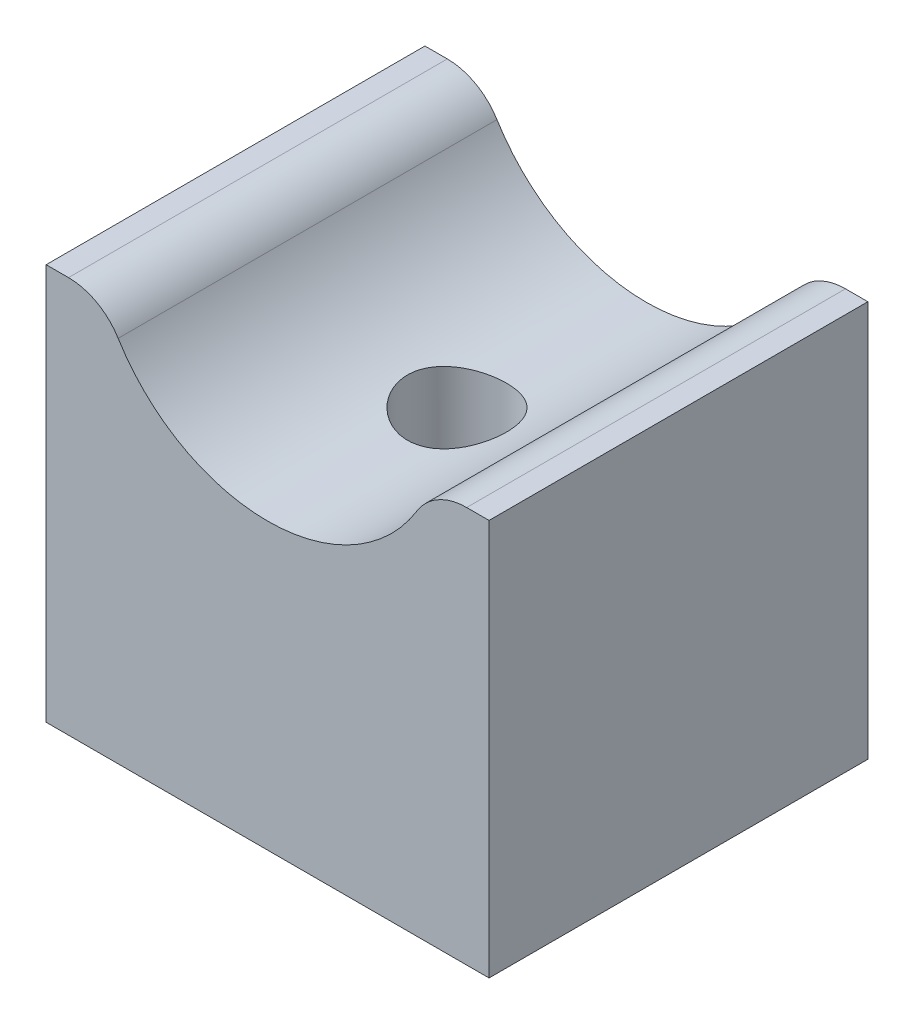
ISO-10303-21;
HEADER;
FILE_DESCRIPTION(('STEP AP214'),'2;1');
FILE_NAME('part.step','',(''),(''),'','','');
FILE_SCHEMA(('AUTOMOTIVE_DESIGN { 1 0 10303 214 1 1 1 1 }'));
ENDSEC;
DATA;
#1=APPLICATION_CONTEXT('core data for automotive mechanical design processes');
#2=APPLICATION_PROTOCOL_DEFINITION('international standard','automotive_design',2000,#1);
#3=PRODUCT_CONTEXT('',#1,'mechanical');
#4=PRODUCT('Part','Part','',(#3));
#5=PRODUCT_RELATED_PRODUCT_CATEGORY('part','',(#4));
#6=PRODUCT_DEFINITION_FORMATION('','',#4);
#7=PRODUCT_DEFINITION_CONTEXT('part definition',#1,'design');
#8=PRODUCT_DEFINITION('design','',#6,#7);
#9=PRODUCT_DEFINITION_SHAPE('','',#8);
#10=(LENGTH_UNIT() NAMED_UNIT(*) SI_UNIT(.MILLI.,.METRE.));
#11=(NAMED_UNIT(*) PLANE_ANGLE_UNIT() SI_UNIT($,.RADIAN.));
#12=(NAMED_UNIT(*) SI_UNIT($,.STERADIAN.) SOLID_ANGLE_UNIT());
#13=UNCERTAINTY_MEASURE_WITH_UNIT(LENGTH_MEASURE(1.E-05),#10,'distance_accuracy_value','');
#14=(GEOMETRIC_REPRESENTATION_CONTEXT(3) GLOBAL_UNCERTAINTY_ASSIGNED_CONTEXT((#13)) GLOBAL_UNIT_ASSIGNED_CONTEXT((#10,
#11,#12)) REPRESENTATION_CONTEXT('',''));
#15=CARTESIAN_POINT('',(0.,0.,0.));
#16=DIRECTION('',(0.,0.,1.));
#17=DIRECTION('',(1.,0.,0.));
#18=AXIS2_PLACEMENT_3D('',#15,#16,#17);
#19=CARTESIAN_POINT('',(-19.,17.,32.5));
#20=DIRECTION('',(0.,-1.,0.));
#21=DIRECTION('',(0.,0.,-1.));
#22=AXIS2_PLACEMENT_3D('',#19,#20,#21);
#23=PLANE('',#22);
#24=DIRECTION('',(-1.,0.,0.));
#25=VECTOR('',#24,1.);
#26=CARTESIAN_POINT('',(-19.,17.,32.5));
#27=LINE('',#26,#25);
#28=CARTESIAN_POINT('',(-17.0807640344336,17.,32.5));
#29=VERTEX_POINT('',#28);
#30=CARTESIAN_POINT('',(-19.,17.,32.5));
#31=VERTEX_POINT('',#30);
#32=EDGE_CURVE('E112',#29,#31,#27,.T.);
#33=ORIENTED_EDGE('',*,*,#32,.F.);
#34=DIRECTION('',(0.,0.,1.));
#35=VECTOR('',#34,1.);
#36=CARTESIAN_POINT('',(-17.0807640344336,17.,0.));
#37=LINE('',#36,#35);
#38=CARTESIAN_POINT('',(-17.0807640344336,17.,0.));
#39=VERTEX_POINT('',#38);
#40=EDGE_CURVE('E12',#29,#39,#37,.F.);
#41=ORIENTED_EDGE('',*,*,#40,.T.);
#42=DIRECTION('',(-1.,0.,0.));
#43=VECTOR('',#42,1.);
#44=CARTESIAN_POINT('',(-19.,17.,0.));
#45=LINE('',#44,#43);
#46=CARTESIAN_POINT('',(-19.,17.,0.));
#47=VERTEX_POINT('',#46);
#48=EDGE_CURVE('E185',#39,#47,#45,.T.);
#49=ORIENTED_EDGE('',*,*,#48,.T.);
#50=DIRECTION('',(0.,0.,-1.));
#51=VECTOR('',#50,1.);
#52=CARTESIAN_POINT('',(-19.,17.,32.5));
#53=LINE('',#52,#51);
#54=EDGE_CURVE('E131',#31,#47,#53,.T.);
#55=ORIENTED_EDGE('',*,*,#54,.F.);
#56=EDGE_LOOP('',(#33,#41,#49,#55));
#57=FACE_BOUND('',#56,.T.);
#58=ADVANCED_FACE('F39',(#57),#23,.F.);
#59=CARTESIAN_POINT('',(19.,17.,0.));
#60=VERTEX_POINT('',#59);
#61=CARTESIAN_POINT('',(17.0807640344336,17.,0.));
#62=VERTEX_POINT('',#61);
#63=EDGE_CURVE('E181',#60,#62,#45,.T.);
#64=ORIENTED_EDGE('',*,*,#63,.T.);
#65=DIRECTION('',(0.,0.,1.));
#66=VECTOR('',#65,1.);
#67=CARTESIAN_POINT('',(17.0807640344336,17.,32.5));
#68=LINE('',#67,#66);
#69=CARTESIAN_POINT('',(17.0807640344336,17.,32.5));
#70=VERTEX_POINT('',#69);
#71=EDGE_CURVE('E63',#62,#70,#68,.T.);
#72=ORIENTED_EDGE('',*,*,#71,.T.);
#73=CARTESIAN_POINT('',(19.,17.,32.5));
#74=VERTEX_POINT('',#73);
#75=EDGE_CURVE('E103',#74,#70,#27,.T.);
#76=ORIENTED_EDGE('',*,*,#75,.F.);
#77=DIRECTION('',(0.,0.,-1.));
#78=VECTOR('',#77,1.);
#79=CARTESIAN_POINT('',(19.,17.,32.5));
#80=LINE('',#79,#78);
#81=EDGE_CURVE('E107',#74,#60,#80,.T.);
#82=ORIENTED_EDGE('',*,*,#81,.T.);
#83=EDGE_LOOP('',(#64,#72,#76,#82));
#84=FACE_BOUND('',#83,.T.);
#85=ADVANCED_FACE('F105',(#84),#23,.F.);
#86=CARTESIAN_POINT('',(19.,17.,32.5));
#87=DIRECTION('',(-1.,0.,0.));
#88=DIRECTION('',(0.,-1.,0.));
#89=AXIS2_PLACEMENT_3D('',#86,#87,#88);
#90=PLANE('',#89);
#91=DIRECTION('',(0.,1.,0.));
#92=VECTOR('',#91,1.);
#93=CARTESIAN_POINT('',(19.,17.,0.));
#94=LINE('',#93,#92);
#95=CARTESIAN_POINT('',(19.,-17.,0.));
#96=VERTEX_POINT('',#95);
#97=EDGE_CURVE('E128',#96,#60,#94,.T.);
#98=ORIENTED_EDGE('',*,*,#97,.T.);
#99=ORIENTED_EDGE('',*,*,#81,.F.);
#100=DIRECTION('',(0.,1.,0.));
#101=VECTOR('',#100,1.);
#102=CARTESIAN_POINT('',(19.,17.,32.5));
#103=LINE('',#102,#101);
#104=CARTESIAN_POINT('',(19.,-17.,32.5));
#105=VERTEX_POINT('',#104);
#106=EDGE_CURVE('E115',#105,#74,#103,.T.);
#107=ORIENTED_EDGE('',*,*,#106,.F.);
#108=DIRECTION('',(0.,0.,-1.));
#109=VECTOR('',#108,1.);
#110=CARTESIAN_POINT('',(19.,-17.,32.5));
#111=LINE('',#110,#109);
#112=EDGE_CURVE('E164',#105,#96,#111,.T.);
#113=ORIENTED_EDGE('',*,*,#112,.T.);
#114=EDGE_LOOP('',(#98,#99,#107,#113));
#115=FACE_BOUND('',#114,.T.);
#116=ADVANCED_FACE('F126',(#115),#90,.F.);
#117=CARTESIAN_POINT('',(-19.,17.,32.5));
#118=DIRECTION('',(1.,0.,0.));
#119=DIRECTION('',(0.,1.,0.));
#120=AXIS2_PLACEMENT_3D('',#117,#118,#119);
#121=PLANE('',#120);
#122=DIRECTION('',(0.,-1.,0.));
#123=VECTOR('',#122,1.);
#124=CARTESIAN_POINT('',(-19.,17.,0.));
#125=LINE('',#124,#123);
#126=CARTESIAN_POINT('',(-19.,-17.,0.));
#127=VERTEX_POINT('',#126);
#128=EDGE_CURVE('E171',#47,#127,#125,.T.);
#129=ORIENTED_EDGE('',*,*,#128,.T.);
#130=DIRECTION('',(0.,0.,-1.));
#131=VECTOR('',#130,1.);
#132=CARTESIAN_POINT('',(-19.,-17.,32.5));
#133=LINE('',#132,#131);
#134=CARTESIAN_POINT('',(-19.,-17.,32.5));
#135=VERTEX_POINT('',#134);
#136=EDGE_CURVE('E140',#135,#127,#133,.T.);
#137=ORIENTED_EDGE('',*,*,#136,.F.);
#138=DIRECTION('',(0.,-1.,0.));
#139=VECTOR('',#138,1.);
#140=CARTESIAN_POINT('',(-19.,17.,32.5));
#141=LINE('',#140,#139);
#142=EDGE_CURVE('E111',#31,#135,#141,.T.);
#143=ORIENTED_EDGE('',*,*,#142,.F.);
#144=ORIENTED_EDGE('',*,*,#54,.T.);
#145=EDGE_LOOP('',(#129,#137,#143,#144));
#146=FACE_BOUND('',#145,.T.);
#147=ADVANCED_FACE('F296',(#146),#121,.F.);
#148=CARTESIAN_POINT('',(-19.,-17.,32.5));
#149=DIRECTION('',(0.,1.,0.));
#150=DIRECTION('',(0.,0.,1.));
#151=AXIS2_PLACEMENT_3D('',#148,#149,#150);
#152=PLANE('',#151);
#153=CARTESIAN_POINT('',(0.,-17.,16.25));
#154=DIRECTION('',(0.,-1.,0.));
#155=DIRECTION('',(0.,0.,-1.));
#156=AXIS2_PLACEMENT_3D('',#153,#154,#155);
#157=CIRCLE('',#156,7.5065);
#158=CARTESIAN_POINT('',(0.,-17.,8.7435));
#159=VERTEX_POINT('',#158);
#160=EDGE_CURVE('E251',#159,#159,#157,.T.);
#161=ORIENTED_EDGE('',*,*,#160,.F.);
#162=EDGE_LOOP('',(#161));
#163=FACE_BOUND('',#162,.T.);
#164=DIRECTION('',(1.,0.,0.));
#165=VECTOR('',#164,1.);
#166=CARTESIAN_POINT('',(-19.,-17.,0.));
#167=LINE('',#166,#165);
#168=EDGE_CURVE('E124',#127,#96,#167,.T.);
#169=ORIENTED_EDGE('',*,*,#168,.T.);
#170=ORIENTED_EDGE('',*,*,#112,.F.);
#171=DIRECTION('',(1.,0.,0.));
#172=VECTOR('',#171,1.);
#173=CARTESIAN_POINT('',(-19.,-17.,32.5));
#174=LINE('',#173,#172);
#175=EDGE_CURVE('E119',#135,#105,#174,.T.);
#176=ORIENTED_EDGE('',*,*,#175,.F.);
#177=ORIENTED_EDGE('',*,*,#136,.T.);
#178=EDGE_LOOP('',(#169,#170,#176,#177));
#179=FACE_BOUND('',#178,.T.);
#180=ADVANCED_FACE('F292',(#163,#179),#152,.F.);
#181=CARTESIAN_POINT('',(0.,0.,32.5));
#182=DIRECTION('',(0.,0.,1.));
#183=DIRECTION('',(1.,0.,0.));
#184=AXIS2_PLACEMENT_3D('',#181,#182,#183);
#185=PLANE('',#184);
#186=ORIENTED_EDGE('',*,*,#75,.T.);
#187=CARTESIAN_POINT('',(17.0807640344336,12.,32.5));
#188=DIRECTION('',(0.,0.,1.));
#189=DIRECTION('',(1.,0.,0.));
#190=AXIS2_PLACEMENT_3D('',#187,#188,#189);
#191=CIRCLE('',#190,5.);
#192=CARTESIAN_POINT('',(12.8212218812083,14.6184538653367,32.5));
#193=VERTEX_POINT('',#192);
#194=EDGE_CURVE('E48',#70,#193,#191,.T.);
#195=ORIENTED_EDGE('',*,*,#194,.T.);
#196=CARTESIAN_POINT('',(0.,22.5,32.5));
#197=DIRECTION('',(0.,0.,1.));
#198=DIRECTION('',(1.,0.,0.));
#199=AXIS2_PLACEMENT_3D('',#196,#197,#198);
#200=CIRCLE('',#199,15.05);
#201=CARTESIAN_POINT('',(-12.8212218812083,14.6184538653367,32.5));
#202=VERTEX_POINT('',#201);
#203=EDGE_CURVE('E190',#202,#193,#200,.T.);
#204=ORIENTED_EDGE('',*,*,#203,.F.);
#205=CARTESIAN_POINT('',(-17.0807640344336,12.,32.5));
#206=DIRECTION('',(0.,0.,1.));
#207=DIRECTION('',(1.,0.,0.));
#208=AXIS2_PLACEMENT_3D('',#205,#206,#207);
#209=CIRCLE('',#208,5.);
#210=EDGE_CURVE('E55',#202,#29,#209,.T.);
#211=ORIENTED_EDGE('',*,*,#210,.T.);
#212=ORIENTED_EDGE('',*,*,#32,.T.);
#213=ORIENTED_EDGE('',*,*,#142,.T.);
#214=ORIENTED_EDGE('',*,*,#175,.T.);
#215=ORIENTED_EDGE('',*,*,#106,.T.);
#216=EDGE_LOOP('',(#186,#195,#204,#211,#212,#213,#214,#215));
#217=FACE_BOUND('',#216,.T.);
#218=ADVANCED_FACE('F117',(#217),#185,.T.);
#219=CARTESIAN_POINT('',(0.,0.,0.));
#220=DIRECTION('',(0.,0.,1.));
#221=DIRECTION('',(1.,0.,0.));
#222=AXIS2_PLACEMENT_3D('',#219,#220,#221);
#223=PLANE('',#222);
#224=CARTESIAN_POINT('',(0.,22.5,0.));
#225=DIRECTION('',(0.,0.,1.));
#226=DIRECTION('',(1.,0.,0.));
#227=AXIS2_PLACEMENT_3D('',#224,#225,#226);
#228=CIRCLE('',#227,15.05);
#229=CARTESIAN_POINT('',(-12.8212218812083,14.6184538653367,0.));
#230=VERTEX_POINT('',#229);
#231=CARTESIAN_POINT('',(12.8212218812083,14.6184538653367,0.));
#232=VERTEX_POINT('',#231);
#233=EDGE_CURVE('E202',#230,#232,#228,.T.);
#234=ORIENTED_EDGE('',*,*,#233,.T.);
#235=CARTESIAN_POINT('',(17.0807640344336,12.,0.));
#236=DIRECTION('',(0.,0.,1.));
#237=DIRECTION('',(1.,0.,0.));
#238=AXIS2_PLACEMENT_3D('',#235,#236,#237);
#239=CIRCLE('',#238,5.);
#240=EDGE_CURVE('E258',#232,#62,#239,.F.);
#241=ORIENTED_EDGE('',*,*,#240,.T.);
#242=ORIENTED_EDGE('',*,*,#63,.F.);
#243=ORIENTED_EDGE('',*,*,#97,.F.);
#244=ORIENTED_EDGE('',*,*,#168,.F.);
#245=ORIENTED_EDGE('',*,*,#128,.F.);
#246=ORIENTED_EDGE('',*,*,#48,.F.);
#247=CARTESIAN_POINT('',(-17.0807640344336,12.,0.));
#248=DIRECTION('',(0.,0.,1.));
#249=DIRECTION('',(1.,0.,0.));
#250=AXIS2_PLACEMENT_3D('',#247,#248,#249);
#251=CIRCLE('',#250,5.);
#252=EDGE_CURVE('E262',#39,#230,#251,.F.);
#253=ORIENTED_EDGE('',*,*,#252,.T.);
#254=EDGE_LOOP('',(#234,#241,#242,#243,#244,#245,#246,#253));
#255=FACE_BOUND('',#254,.T.);
#256=ADVANCED_FACE('F350',(#255),#223,.F.);
#257=CARTESIAN_POINT('',(0.,22.5,32.5));
#258=DIRECTION('',(0.,0.,-1.));
#259=DIRECTION('',(-1.,0.,0.));
#260=AXIS2_PLACEMENT_3D('',#257,#258,#259);
#261=CYLINDRICAL_SURFACE('',#260,15.05);
#262=CARTESIAN_POINT('',(0.,7.45,12.));
#263=CARTESIAN_POINT('',(-0.233768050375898,7.45000293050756,12.0000043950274));
#264=CARTESIAN_POINT('',(-0.467581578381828,7.45549950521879,12.0193517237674));
#265=CARTESIAN_POINT('',(-0.92843924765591,7.47689124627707,12.0960716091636));
#266=CARTESIAN_POINT('',(-1.15548066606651,7.49279053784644,12.1534592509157));
#267=CARTESIAN_POINT('',(-1.5960777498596,7.53323864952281,12.3042197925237));
#268=CARTESIAN_POINT('',(-1.80965149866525,7.55777556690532,12.3975431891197));
#269=CARTESIAN_POINT('',(-2.21811836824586,7.6129255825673,12.6173335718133));
#270=CARTESIAN_POINT('',(-2.41300965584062,7.64353927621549,12.7438038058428));
#271=CARTESIAN_POINT('',(-2.78359546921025,7.70843691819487,13.029731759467));
#272=CARTESIAN_POINT('',(-2.95874083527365,7.74278945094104,13.1898856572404));
#273=CARTESIAN_POINT('',(-3.28007855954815,7.81086726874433,13.5371486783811));
#274=CARTESIAN_POINT('',(-3.42626669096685,7.84459246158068,13.724261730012));
#275=CARTESIAN_POINT('',(-3.6883141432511,7.90830941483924,14.1246351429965));
#276=CARTESIAN_POINT('',(-3.80352412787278,7.93821522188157,14.3383354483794));
#277=CARTESIAN_POINT('',(-3.9961556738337,7.98989121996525,14.783056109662));
#278=CARTESIAN_POINT('',(-4.07358515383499,8.01166311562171,15.0140728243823));
#279=CARTESIAN_POINT('',(-4.18651698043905,8.04389504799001,15.4807463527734));
#280=CARTESIAN_POINT('',(-4.22302286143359,8.05462528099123,15.7161411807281));
#281=CARTESIAN_POINT('',(-4.25620235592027,8.0643647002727,16.1899398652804));
#282=CARTESIAN_POINT('',(-4.25288440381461,8.06337636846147,16.42834307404));
#283=CARTESIAN_POINT('',(-4.20730321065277,8.0500310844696,16.8934112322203));
#284=CARTESIAN_POINT('',(-4.16627351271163,8.03803423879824,17.1202090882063));
#285=CARTESIAN_POINT('',(-4.04841711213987,8.00460300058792,17.5635624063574));
#286=CARTESIAN_POINT('',(-3.9715872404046,7.98316777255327,17.7801169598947));
#287=CARTESIAN_POINT('',(-3.78335110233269,7.9329719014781,18.1999605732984));
#288=CARTESIAN_POINT('',(-3.67152735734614,7.90412360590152,18.4030515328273));
#289=CARTESIAN_POINT('',(-3.41676840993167,7.84239688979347,18.7880105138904));
#290=CARTESIAN_POINT('',(-3.27382642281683,7.8095175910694,18.9698738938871));
#291=CARTESIAN_POINT('',(-2.95466408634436,7.74195211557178,19.3142402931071));
#292=CARTESIAN_POINT('',(-2.7774132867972,7.70724395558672,19.4757854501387));
#293=CARTESIAN_POINT('',(-2.39790736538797,7.64100978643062,19.7670667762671));
#294=CARTESIAN_POINT('',(-2.19565100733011,7.60948393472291,19.8968013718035));
#295=CARTESIAN_POINT('',(-1.77027446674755,7.55293178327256,20.1212726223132));
#296=CARTESIAN_POINT('',(-1.54704832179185,7.52794120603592,20.2158180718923));
#297=CARTESIAN_POINT('',(-1.08699889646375,7.48753286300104,20.365753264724));
#298=CARTESIAN_POINT('',(-0.850178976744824,7.47211274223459,20.421152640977));
#299=CARTESIAN_POINT('',(-0.377824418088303,7.4529464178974,20.4896777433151));
#300=CARTESIAN_POINT('',(-0.142492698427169,7.44884125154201,20.5041038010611));
#301=CARTESIAN_POINT('',(0.327234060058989,7.45172568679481,20.4938883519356));
#302=CARTESIAN_POINT('',(0.56162920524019,7.45871399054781,20.4692514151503));
#303=CARTESIAN_POINT('',(1.01806587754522,7.48276672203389,20.3826695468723));
#304=CARTESIAN_POINT('',(1.24025952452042,7.499630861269,20.3214657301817));
#305=CARTESIAN_POINT('',(1.6711922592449,7.54150653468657,20.1643622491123));
#306=CARTESIAN_POINT('',(1.87992980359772,7.56651900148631,20.0684586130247));
#307=CARTESIAN_POINT('',(2.28295543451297,7.62273785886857,19.8423720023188));
#308=CARTESIAN_POINT('',(2.47684118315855,7.65406480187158,19.7115025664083));
#309=CARTESIAN_POINT('',(2.84035063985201,7.71930070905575,19.420048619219));
#310=CARTESIAN_POINT('',(3.00996894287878,7.75321024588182,19.2594575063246));
#311=CARTESIAN_POINT('',(3.3257237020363,7.8211372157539,18.907027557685));
#312=CARTESIAN_POINT('',(3.47093857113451,7.85512358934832,18.7143553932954));
#313=CARTESIAN_POINT('',(3.72701552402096,7.91818558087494,18.3066463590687));
#314=CARTESIAN_POINT('',(3.83787885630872,7.94726137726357,18.0916103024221));
#315=CARTESIAN_POINT('',(4.02128979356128,7.99687057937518,17.6462084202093));
#316=CARTESIAN_POINT('',(4.09404479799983,8.01745009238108,17.4159334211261));
#317=CARTESIAN_POINT('',(4.19958075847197,8.04769592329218,16.9457258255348));
#318=CARTESIAN_POINT('',(4.23237347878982,8.05736545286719,16.7057960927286));
#319=CARTESIAN_POINT('',(4.25631892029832,8.06440567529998,16.2325864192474));
#320=CARTESIAN_POINT('',(4.24896206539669,8.06221660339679,15.9993873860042));
#321=CARTESIAN_POINT('',(4.19632050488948,8.04682975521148,15.5376991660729));
#322=CARTESIAN_POINT('',(4.15103701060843,8.03363233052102,15.3092098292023));
#323=CARTESIAN_POINT('',(4.02473839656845,7.99799357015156,14.8655587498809));
#324=CARTESIAN_POINT('',(3.94407520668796,7.97564342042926,14.650288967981));
#325=CARTESIAN_POINT('',(3.74957907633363,7.92422455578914,14.2361693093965));
#326=CARTESIAN_POINT('',(3.63574037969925,7.89515467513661,14.0373222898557));
#327=CARTESIAN_POINT('',(3.37376036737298,7.83238531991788,13.6546682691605));
#328=CARTESIAN_POINT('',(3.22461946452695,7.79856558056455,13.4715653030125));
#329=CARTESIAN_POINT('',(2.89812276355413,7.73073664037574,13.1325015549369));
#330=CARTESIAN_POINT('',(2.72075991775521,7.69672739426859,12.9765475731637));
#331=CARTESIAN_POINT('',(2.33753514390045,7.63133853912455,12.692370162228));
#332=CARTESIAN_POINT('',(2.13107414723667,7.60004536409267,12.5649328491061));
#333=CARTESIAN_POINT('',(1.69877528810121,7.54459911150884,12.3467700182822));
#334=CARTESIAN_POINT('',(1.47294843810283,7.52044201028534,12.2560238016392));
#335=CARTESIAN_POINT('',(1.0403760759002,7.48465499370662,12.1239822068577));
#336=CARTESIAN_POINT('',(0.835273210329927,7.47175974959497,12.0776048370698));
#337=CARTESIAN_POINT('',(0.420125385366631,7.45443147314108,12.0156137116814));
#338=CARTESIAN_POINT('',(0.210081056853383,7.4499973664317,11.9999960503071));
#339=CARTESIAN_POINT('',(0.,7.45,12.));
#340=B_SPLINE_CURVE_WITH_KNOTS('',3,(#262,#263,#264,#265,#266,#267,#268,#269,#270,#271,#272,
#273,#274,#275,#276,#277,#278,#279,#280,#281,#282,#283,#284,#285,#286,#287,#288,#289,#290,#291,
#292,#293,#294,#295,#296,#297,#298,#299,#300,#301,#302,#303,#304,#305,#306,#307,#308,#309,#310,
#311,#312,#313,#314,#315,#316,#317,#318,#319,#320,#321,#322,#323,#324,#325,#326,#327,#328,#329,
#330,#331,#332,#333,#334,#335,#336,#337,#338,#339),.UNSPECIFIED.,.T.,.F.,(4,2,2,2,2,2,2,2,2,2,2,
2,2,2,2,2,2,2,2,2,2,2,2,2,2,2,2,2,2,2,2,2,2,2,2,2,2,2,4),(0.,0.700533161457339,1.40134428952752,
2.10119344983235,2.80111121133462,3.51723970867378,4.23347266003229,4.96371858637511,
5.6938113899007,6.40557992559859,7.11719771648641,7.80633640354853,8.49553610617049,
9.19329337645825,9.89120293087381,10.6147766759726,11.3383862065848,12.0658720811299,
12.7931788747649,13.4971310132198,14.2010008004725,14.8910671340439,15.5812124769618,
16.2860538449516,16.9910519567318,17.7185376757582,18.445996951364,19.1694548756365,
19.8926997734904,20.589283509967,21.2858449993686,21.9756294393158,22.6655336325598,
23.3779878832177,24.0906203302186,24.8209758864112,25.5509188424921,26.180549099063,
26.8100994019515),.UNSPECIFIED.);
#341=CARTESIAN_POINT('',(0.,7.45,12.));
#342=VERTEX_POINT('',#341);
#343=EDGE_CURVE('E146',#342,#342,#340,.T.);
#344=ORIENTED_EDGE('',*,*,#343,.F.);
#345=EDGE_LOOP('',(#344));
#346=FACE_BOUND('',#345,.T.);
#347=ORIENTED_EDGE('',*,*,#203,.T.);
#348=DIRECTION('',(0.,0.,-1.));
#349=VECTOR('',#348,1.);
#350=CARTESIAN_POINT('',(12.8212218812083,14.6184538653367,32.5));
#351=LINE('',#350,#349);
#352=EDGE_CURVE('E137',#193,#232,#351,.T.);
#353=ORIENTED_EDGE('',*,*,#352,.T.);
#354=ORIENTED_EDGE('',*,*,#233,.F.);
#355=DIRECTION('',(0.,0.,-1.));
#356=VECTOR('',#355,1.);
#357=CARTESIAN_POINT('',(-12.8212218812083,14.6184538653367,32.5));
#358=LINE('',#357,#356);
#359=EDGE_CURVE('E130',#230,#202,#358,.F.);
#360=ORIENTED_EDGE('',*,*,#359,.T.);
#361=EDGE_LOOP('',(#347,#353,#354,#360));
#362=FACE_BOUND('',#361,.T.);
#363=ADVANCED_FACE('F234',(#346,#362),#261,.F.);
#364=CARTESIAN_POINT('',(0.,-17.,16.25));
#365=DIRECTION('',(0.,-1.,0.));
#366=DIRECTION('',(0.,0.,-1.));
#367=AXIS2_PLACEMENT_3D('',#364,#365,#366);
#368=CYLINDRICAL_SURFACE('',#367,4.24999999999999);
#369=ORIENTED_EDGE('',*,*,#343,.T.);
#370=EDGE_LOOP('',(#369));
#371=FACE_BOUND('',#370,.T.);
#372=CARTESIAN_POINT('',(0.,-15.,16.25));
#373=DIRECTION('',(0.,-1.,0.));
#374=DIRECTION('',(0.,0.,-1.));
#375=AXIS2_PLACEMENT_3D('',#372,#373,#374);
#376=CIRCLE('',#375,4.25);
#377=CARTESIAN_POINT('',(0.,-15.,12.));
#378=VERTEX_POINT('',#377);
#379=EDGE_CURVE('E203',#378,#378,#376,.T.);
#380=ORIENTED_EDGE('',*,*,#379,.T.);
#381=EDGE_LOOP('',(#380));
#382=FACE_BOUND('',#381,.T.);
#383=ADVANCED_FACE('F228',(#371,#382),#368,.F.);
#384=CARTESIAN_POINT('',(4.25,-15.,16.25));
#385=DIRECTION('',(0.,1.,0.));
#386=DIRECTION('',(0.,0.,1.));
#387=AXIS2_PLACEMENT_3D('',#384,#385,#386);
#388=PLANE('',#387);
#389=ORIENTED_EDGE('',*,*,#379,.F.);
#390=EDGE_LOOP('',(#389));
#391=FACE_BOUND('',#390,.T.);
#392=CARTESIAN_POINT('',(0.,-15.,16.25));
#393=DIRECTION('',(0.,-1.,0.));
#394=DIRECTION('',(0.,0.,-1.));
#395=AXIS2_PLACEMENT_3D('',#392,#393,#394);
#396=CIRCLE('',#395,7.5065);
#397=CARTESIAN_POINT('',(0.,-15.,8.7435));
#398=VERTEX_POINT('',#397);
#399=EDGE_CURVE('E227',#398,#398,#396,.T.);
#400=ORIENTED_EDGE('',*,*,#399,.T.);
#401=EDGE_LOOP('',(#400));
#402=FACE_BOUND('',#401,.T.);
#403=ADVANCED_FACE('F233',(#391,#402),#388,.F.);
#404=CARTESIAN_POINT('',(0.,-17.,16.25));
#405=DIRECTION('',(0.,-1.,0.));
#406=DIRECTION('',(0.,0.,-1.));
#407=AXIS2_PLACEMENT_3D('',#404,#405,#406);
#408=CYLINDRICAL_SURFACE('',#407,7.5065);
#409=ORIENTED_EDGE('',*,*,#399,.F.);
#410=EDGE_LOOP('',(#409));
#411=FACE_BOUND('',#410,.T.);
#412=ORIENTED_EDGE('',*,*,#160,.T.);
#413=EDGE_LOOP('',(#412));
#414=FACE_BOUND('',#413,.T.);
#415=ADVANCED_FACE('F307',(#411,#414),#408,.F.);
#416=CARTESIAN_POINT('',(17.0807640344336,12.,32.5));
#417=DIRECTION('',(0.,0.,-1.));
#418=DIRECTION('',(-1.,0.,0.));
#419=AXIS2_PLACEMENT_3D('',#416,#417,#418);
#420=CYLINDRICAL_SURFACE('',#419,5.);
#421=ORIENTED_EDGE('',*,*,#194,.F.);
#422=ORIENTED_EDGE('',*,*,#71,.F.);
#423=ORIENTED_EDGE('',*,*,#240,.F.);
#424=ORIENTED_EDGE('',*,*,#352,.F.);
#425=EDGE_LOOP('',(#421,#422,#423,#424));
#426=FACE_BOUND('',#425,.T.);
#427=ADVANCED_FACE('F382',(#426),#420,.T.);
#428=CARTESIAN_POINT('',(-17.0807640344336,12.,32.5));
#429=DIRECTION('',(0.,0.,-1.));
#430=DIRECTION('',(-1.,0.,0.));
#431=AXIS2_PLACEMENT_3D('',#428,#429,#430);
#432=CYLINDRICAL_SURFACE('',#431,5.);
#433=ORIENTED_EDGE('',*,*,#252,.F.);
#434=ORIENTED_EDGE('',*,*,#40,.F.);
#435=ORIENTED_EDGE('',*,*,#210,.F.);
#436=ORIENTED_EDGE('',*,*,#359,.F.);
#437=EDGE_LOOP('',(#433,#434,#435,#436));
#438=FACE_BOUND('',#437,.T.);
#439=ADVANCED_FACE('F41',(#438),#432,.T.);
#440=CLOSED_SHELL('',(#58,#85,#116,#147,#180,#218,#256,#363,#383,#403,#415,#427,#439));
#441=MANIFOLD_SOLID_BREP('B2',#440);
#442=ADVANCED_BREP_SHAPE_REPRESENTATION('',(#18,#441),#14);
#443=SHAPE_DEFINITION_REPRESENTATION(#9,#442);
ENDSEC;
END-ISO-10303-21;
